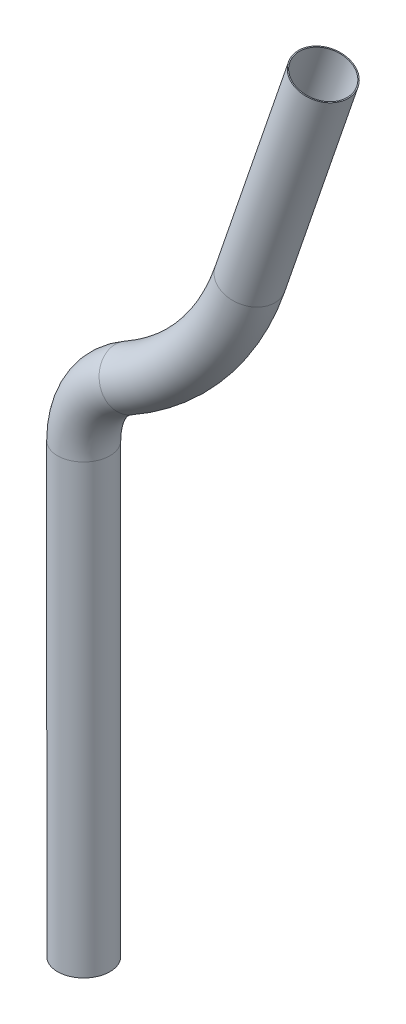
ISO-10303-21;
HEADER;
FILE_DESCRIPTION(('STEP AP214'),'2;1');
FILE_NAME('part.step','',(''),(''),'','','');
FILE_SCHEMA(('AUTOMOTIVE_DESIGN { 1 0 10303 214 1 1 1 1 }'));
ENDSEC;
DATA;
#1=APPLICATION_CONTEXT('core data for automotive mechanical design processes');
#2=APPLICATION_PROTOCOL_DEFINITION('international standard','automotive_design',2000,#1);
#3=PRODUCT_CONTEXT('',#1,'mechanical');
#4=PRODUCT('Part','Part','',(#3));
#5=PRODUCT_RELATED_PRODUCT_CATEGORY('part','',(#4));
#6=PRODUCT_DEFINITION_FORMATION('','',#4);
#7=PRODUCT_DEFINITION_CONTEXT('part definition',#1,'design');
#8=PRODUCT_DEFINITION('design','',#6,#7);
#9=PRODUCT_DEFINITION_SHAPE('','',#8);
#10=(LENGTH_UNIT() NAMED_UNIT(*) SI_UNIT(.MILLI.,.METRE.));
#11=(NAMED_UNIT(*) PLANE_ANGLE_UNIT() SI_UNIT($,.RADIAN.));
#12=(NAMED_UNIT(*) SI_UNIT($,.STERADIAN.) SOLID_ANGLE_UNIT());
#13=UNCERTAINTY_MEASURE_WITH_UNIT(LENGTH_MEASURE(1.E-05),#10,'distance_accuracy_value','');
#14=(GEOMETRIC_REPRESENTATION_CONTEXT(3) GLOBAL_UNCERTAINTY_ASSIGNED_CONTEXT((#13)) GLOBAL_UNIT_ASSIGNED_CONTEXT((#10,
#11,#12)) REPRESENTATION_CONTEXT('',''));
#15=CARTESIAN_POINT('',(0.,0.,0.));
#16=DIRECTION('',(0.,0.,1.));
#17=DIRECTION('',(1.,0.,0.));
#18=AXIS2_PLACEMENT_3D('',#15,#16,#17);
#19=CARTESIAN_POINT('',(41.3308125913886,166.558637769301,0.));
#20=DIRECTION('',(0.324222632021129,0.945980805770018,0.));
#21=DIRECTION('',(-0.945980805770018,0.324222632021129,0.));
#22=AXIS2_PLACEMENT_3D('',#19,#20,#21);
#23=CYLINDRICAL_SURFACE('',#22,6.50571757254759);
#24=CARTESIAN_POINT('',(41.3308125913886,166.558637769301,0.));
#25=DIRECTION('',(0.324222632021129,0.945980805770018,0.));
#26=DIRECTION('',(-0.945980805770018,0.324222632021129,0.));
#27=AXIS2_PLACEMENT_3D('',#24,#25,#26);
#28=CIRCLE('',#27,6.50571757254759);
#29=CARTESIAN_POINT('',(47.4850965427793,164.449336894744,0.));
#30=VERTEX_POINT('',#29);
#31=EDGE_CURVE('E32',#30,#30,#28,.T.);
#32=ORIENTED_EDGE('',*,*,#31,.T.);
#33=EDGE_LOOP('',(#32));
#34=FACE_BOUND('',#33,.T.);
#35=CARTESIAN_POINT('',(59.5166346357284,219.619210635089,0.));
#36=DIRECTION('',(0.324222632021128,0.945980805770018,0.));
#37=DIRECTION('',(-0.945980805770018,0.324222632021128,0.));
#38=AXIS2_PLACEMENT_3D('',#35,#36,#37);
#39=CIRCLE('',#38,6.50571757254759);
#40=CARTESIAN_POINT('',(53.3623506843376,221.728511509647,0.));
#41=VERTEX_POINT('',#40);
#42=EDGE_CURVE('E10',#41,#41,#39,.T.);
#43=ORIENTED_EDGE('',*,*,#42,.F.);
#44=EDGE_LOOP('',(#43));
#45=FACE_BOUND('',#44,.T.);
#46=ADVANCED_FACE('F24',(#34,#45),#23,.T.);
#47=CARTESIAN_POINT('',(-21.9746115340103,188.255749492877,0.));
#48=DIRECTION('',(0.,0.,1.));
#49=DIRECTION('',(1.,0.,0.));
#50=AXIS2_PLACEMENT_3D('',#47,#48,#49);
#51=TOROIDAL_SURFACE('',#50,66.9204107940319,6.50571757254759);
#52=CARTESIAN_POINT('',(11.0732957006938,130.064880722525,0.));
#53=DIRECTION('',(-0.86955337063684,-0.493838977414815,0.));
#54=DIRECTION('',(0.493838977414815,-0.86955337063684,0.));
#55=AXIS2_PLACEMENT_3D('',#52,#53,#54);
#56=CIRCLE('',#55,6.50571757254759);
#57=CARTESIAN_POINT('',(14.2860726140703,124.407812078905,0.));
#58=VERTEX_POINT('',#57);
#59=EDGE_CURVE('E36',#58,#58,#56,.F.);
#60=CARTESIAN_POINT('',(-21.9746115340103,188.255749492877,0.));
#61=DIRECTION('',(0.,0.,1.));
#62=DIRECTION('',(1.,0.,0.));
#63=AXIS2_PLACEMENT_3D('',#60,#61,#62);
#64=CIRCLE('',#63,73.4261283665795);
#65=EDGE_CURVE('',#58,#30,#64,.T.);
#66=ORIENTED_EDGE('',*,*,#59,.T.);
#67=ORIENTED_EDGE('',*,*,#31,.F.);
#68=ORIENTED_EDGE('',*,*,#65,.T.);
#69=ORIENTED_EDGE('',*,*,#65,.F.);
#70=EDGE_LOOP('',(#66,#68,#67,#69));
#71=FACE_BOUND('',#70,.T.);
#72=ADVANCED_FACE('F82',(#71),#51,.T.);
#73=CARTESIAN_POINT('',(21.8770217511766,111.041642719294,0.));
#74=DIRECTION('',(0.,0.,-1.));
#75=DIRECTION('',(-1.,0.,0.));
#76=AXIS2_PLACEMENT_3D('',#73,#74,#75);
#77=TOROIDAL_SURFACE('',#76,21.8770217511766,6.50571757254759);
#78=CARTESIAN_POINT('',(0.,111.041642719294,0.));
#79=DIRECTION('',(0.,-1.,0.));
#80=DIRECTION('',(0.,0.,-1.));
#81=AXIS2_PLACEMENT_3D('',#78,#79,#80);
#82=CIRCLE('',#81,6.50571757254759);
#83=CARTESIAN_POINT('',(0.,111.041642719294,-6.50571757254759));
#84=VERTEX_POINT('',#83);
#85=EDGE_CURVE('E39',#84,#84,#82,.F.);
#86=ORIENTED_EDGE('',*,*,#85,.T.);
#87=EDGE_LOOP('',(#86));
#88=FACE_BOUND('',#87,.T.);
#89=ORIENTED_EDGE('',*,*,#59,.F.);
#90=EDGE_LOOP('',(#89));
#91=FACE_BOUND('',#90,.T.);
#92=ADVANCED_FACE('F78',(#88,#91),#77,.T.);
#93=CARTESIAN_POINT('',(0.,111.041642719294,0.));
#94=DIRECTION('',(0.,-1.,0.));
#95=DIRECTION('',(0.,0.,-1.));
#96=AXIS2_PLACEMENT_3D('',#93,#94,#95);
#97=CYLINDRICAL_SURFACE('',#96,6.50571757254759);
#98=ORIENTED_EDGE('',*,*,#85,.F.);
#99=EDGE_LOOP('',(#98));
#100=FACE_BOUND('',#99,.T.);
#101=CARTESIAN_POINT('',(0.,0.,0.));
#102=DIRECTION('',(0.,1.,0.));
#103=DIRECTION('',(0.,0.,1.));
#104=AXIS2_PLACEMENT_3D('',#101,#102,#103);
#105=CIRCLE('',#104,6.50571757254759);
#106=CARTESIAN_POINT('',(0.,0.,6.50571757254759));
#107=VERTEX_POINT('',#106);
#108=EDGE_CURVE('E28',#107,#107,#105,.T.);
#109=ORIENTED_EDGE('',*,*,#108,.T.);
#110=EDGE_LOOP('',(#109));
#111=FACE_BOUND('',#110,.T.);
#112=ADVANCED_FACE('F26',(#100,#111),#97,.T.);
#113=CARTESIAN_POINT('',(59.5166346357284,219.619210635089,0.));
#114=DIRECTION('',(0.324222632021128,0.945980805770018,0.));
#115=DIRECTION('',(0.,0.,1.));
#116=AXIS2_PLACEMENT_3D('',#113,#114,#115);
#117=PLANE('',#116);
#118=ORIENTED_EDGE('',*,*,#42,.T.);
#119=EDGE_LOOP('',(#118));
#120=FACE_BOUND('',#119,.T.);
#121=CARTESIAN_POINT('',(59.5166346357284,219.619210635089,0.));
#122=DIRECTION('',(0.324222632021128,0.945980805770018,0.));
#123=DIRECTION('',(-0.945980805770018,0.324222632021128,0.));
#124=AXIS2_PLACEMENT_3D('',#121,#122,#123);
#125=CIRCLE('',#124,6.25171757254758);
#126=CARTESIAN_POINT('',(53.6026298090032,221.646158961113,0.));
#127=VERTEX_POINT('',#126);
#128=EDGE_CURVE('E48',#127,#127,#125,.T.);
#129=ORIENTED_EDGE('',*,*,#128,.F.);
#130=EDGE_LOOP('',(#129));
#131=FACE_BOUND('',#130,.T.);
#132=ADVANCED_FACE('F69',(#120,#131),#117,.T.);
#133=CARTESIAN_POINT('',(0.,0.,0.));
#134=DIRECTION('',(0.,1.,0.));
#135=DIRECTION('',(0.,0.,1.));
#136=AXIS2_PLACEMENT_3D('',#133,#134,#135);
#137=PLANE('',#136);
#138=ORIENTED_EDGE('',*,*,#108,.F.);
#139=EDGE_LOOP('',(#138));
#140=FACE_BOUND('',#139,.T.);
#141=CARTESIAN_POINT('',(0.,0.,0.));
#142=DIRECTION('',(0.,1.,0.));
#143=DIRECTION('',(0.,0.,1.));
#144=AXIS2_PLACEMENT_3D('',#141,#142,#143);
#145=CIRCLE('',#144,6.25171757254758);
#146=CARTESIAN_POINT('',(0.,0.,6.25171757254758));
#147=VERTEX_POINT('',#146);
#148=EDGE_CURVE('E44',#147,#147,#145,.T.);
#149=ORIENTED_EDGE('',*,*,#148,.T.);
#150=EDGE_LOOP('',(#149));
#151=FACE_BOUND('',#150,.T.);
#152=ADVANCED_FACE('F65',(#140,#151),#137,.F.);
#153=CARTESIAN_POINT('',(41.3308125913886,166.558637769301,0.));
#154=DIRECTION('',(0.324222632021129,0.945980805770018,0.));
#155=DIRECTION('',(-0.945980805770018,0.324222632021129,0.));
#156=AXIS2_PLACEMENT_3D('',#153,#154,#155);
#157=CYLINDRICAL_SURFACE('',#156,6.25171757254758);
#158=CARTESIAN_POINT('',(41.3308125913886,166.558637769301,0.));
#159=DIRECTION('',(0.324222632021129,0.945980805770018,0.));
#160=DIRECTION('',(-0.945980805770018,0.324222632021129,0.));
#161=AXIS2_PLACEMENT_3D('',#158,#159,#160);
#162=CIRCLE('',#161,6.25171757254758);
#163=CARTESIAN_POINT('',(47.2448174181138,164.531689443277,0.));
#164=VERTEX_POINT('',#163);
#165=EDGE_CURVE('E51',#164,#164,#162,.T.);
#166=ORIENTED_EDGE('',*,*,#165,.F.);
#167=EDGE_LOOP('',(#166));
#168=FACE_BOUND('',#167,.T.);
#169=ORIENTED_EDGE('',*,*,#128,.T.);
#170=EDGE_LOOP('',(#169));
#171=FACE_BOUND('',#170,.T.);
#172=ADVANCED_FACE('F62',(#168,#171),#157,.F.);
#173=CARTESIAN_POINT('',(-21.9746115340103,188.255749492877,0.));
#174=DIRECTION('',(0.,0.,1.));
#175=DIRECTION('',(1.,0.,0.));
#176=AXIS2_PLACEMENT_3D('',#173,#174,#175);
#177=TOROIDAL_SURFACE('',#176,66.9204107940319,6.25171757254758);
#178=CARTESIAN_POINT('',(11.0732957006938,130.064880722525,0.));
#179=DIRECTION('',(-0.86955337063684,-0.493838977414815,0.));
#180=DIRECTION('',(0.493838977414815,-0.86955337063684,0.));
#181=AXIS2_PLACEMENT_3D('',#178,#179,#180);
#182=CIRCLE('',#181,6.25171757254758);
#183=CARTESIAN_POINT('',(14.160637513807,124.628678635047,0.));
#184=VERTEX_POINT('',#183);
#185=EDGE_CURVE('E54',#184,#184,#182,.F.);
#186=CARTESIAN_POINT('',(-21.9746115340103,188.255749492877,0.));
#187=DIRECTION('',(0.,0.,1.));
#188=DIRECTION('',(1.,0.,0.));
#189=AXIS2_PLACEMENT_3D('',#186,#187,#188);
#190=CIRCLE('',#189,73.1721283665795);
#191=EDGE_CURVE('',#184,#164,#190,.T.);
#192=ORIENTED_EDGE('',*,*,#185,.F.);
#193=ORIENTED_EDGE('',*,*,#165,.T.);
#194=ORIENTED_EDGE('',*,*,#191,.T.);
#195=ORIENTED_EDGE('',*,*,#191,.F.);
#196=EDGE_LOOP('',(#192,#194,#193,#195));
#197=FACE_BOUND('',#196,.T.);
#198=ADVANCED_FACE('F60',(#197),#177,.F.);
#199=CARTESIAN_POINT('',(21.8770217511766,111.041642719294,0.));
#200=DIRECTION('',(0.,0.,-1.));
#201=DIRECTION('',(-1.,0.,0.));
#202=AXIS2_PLACEMENT_3D('',#199,#200,#201);
#203=TOROIDAL_SURFACE('',#202,21.8770217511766,6.25171757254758);
#204=CARTESIAN_POINT('',(0.,111.041642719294,0.));
#205=DIRECTION('',(0.,-1.,0.));
#206=DIRECTION('',(0.,0.,-1.));
#207=AXIS2_PLACEMENT_3D('',#204,#205,#206);
#208=CIRCLE('',#207,6.25171757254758);
#209=CARTESIAN_POINT('',(0.,111.041642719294,-6.25171757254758));
#210=VERTEX_POINT('',#209);
#211=EDGE_CURVE('E47',#210,#210,#208,.F.);
#212=ORIENTED_EDGE('',*,*,#211,.F.);
#213=EDGE_LOOP('',(#212));
#214=FACE_BOUND('',#213,.T.);
#215=ORIENTED_EDGE('',*,*,#185,.T.);
#216=EDGE_LOOP('',(#215));
#217=FACE_BOUND('',#216,.T.);
#218=ADVANCED_FACE('F107',(#214,#217),#203,.F.);
#219=CARTESIAN_POINT('',(0.,111.041642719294,0.));
#220=DIRECTION('',(0.,-1.,0.));
#221=DIRECTION('',(0.,0.,-1.));
#222=AXIS2_PLACEMENT_3D('',#219,#220,#221);
#223=CYLINDRICAL_SURFACE('',#222,6.25171757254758);
#224=ORIENTED_EDGE('',*,*,#211,.T.);
#225=EDGE_LOOP('',(#224));
#226=FACE_BOUND('',#225,.T.);
#227=ORIENTED_EDGE('',*,*,#148,.F.);
#228=EDGE_LOOP('',(#227));
#229=FACE_BOUND('',#228,.T.);
#230=ADVANCED_FACE('F105',(#226,#229),#223,.F.);
#231=CLOSED_SHELL('',(#46,#72,#92,#112,#132,#152,#172,#198,#218,#230));
#232=MANIFOLD_SOLID_BREP('B2',#231);
#233=ADVANCED_BREP_SHAPE_REPRESENTATION('',(#18,#232),#14);
#234=SHAPE_DEFINITION_REPRESENTATION(#9,#233);
ENDSEC;
END-ISO-10303-21;
